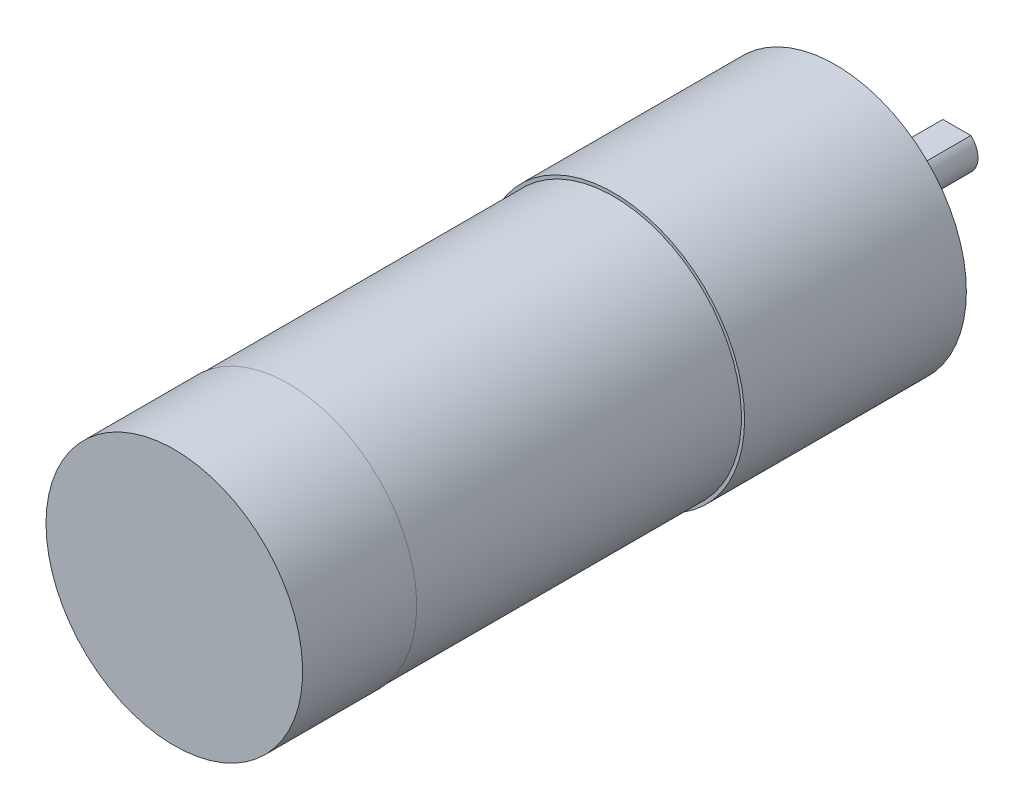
ISO-10303-21;
HEADER;
FILE_DESCRIPTION(('STEP AP214'),'2;1');
FILE_NAME('part.step','',(''),(''),'','','');
FILE_SCHEMA(('AUTOMOTIVE_DESIGN { 1 0 10303 214 1 1 1 1 }'));
ENDSEC;
DATA;
#1=APPLICATION_CONTEXT('core data for automotive mechanical design processes');
#2=APPLICATION_PROTOCOL_DEFINITION('international standard','automotive_design',2000,#1);
#3=PRODUCT_CONTEXT('',#1,'mechanical');
#4=PRODUCT('Part','Part','',(#3));
#5=PRODUCT_RELATED_PRODUCT_CATEGORY('part','',(#4));
#6=PRODUCT_DEFINITION_FORMATION('','',#4);
#7=PRODUCT_DEFINITION_CONTEXT('part definition',#1,'design');
#8=PRODUCT_DEFINITION('design','',#6,#7);
#9=PRODUCT_DEFINITION_SHAPE('','',#8);
#10=(LENGTH_UNIT() NAMED_UNIT(*) SI_UNIT(.MILLI.,.METRE.));
#11=(NAMED_UNIT(*) PLANE_ANGLE_UNIT() SI_UNIT($,.RADIAN.));
#12=(NAMED_UNIT(*) SI_UNIT($,.STERADIAN.) SOLID_ANGLE_UNIT());
#13=UNCERTAINTY_MEASURE_WITH_UNIT(LENGTH_MEASURE(1.E-05),#10,'distance_accuracy_value','');
#14=(GEOMETRIC_REPRESENTATION_CONTEXT(3) GLOBAL_UNCERTAINTY_ASSIGNED_CONTEXT((#13)) GLOBAL_UNIT_ASSIGNED_CONTEXT((#10,
#11,#12)) REPRESENTATION_CONTEXT('',''));
#15=CARTESIAN_POINT('',(0.,0.,0.));
#16=DIRECTION('',(0.,0.,1.));
#17=DIRECTION('',(1.,0.,0.));
#18=AXIS2_PLACEMENT_3D('',#15,#16,#17);
#19=CARTESIAN_POINT('',(0.,0.,21.));
#20=DIRECTION('',(0.,0.,-1.));
#21=DIRECTION('',(-1.,0.,0.));
#22=AXIS2_PLACEMENT_3D('',#19,#20,#21);
#23=CYLINDRICAL_SURFACE('',#22,12.4);
#24=CARTESIAN_POINT('',(0.,0.,21.));
#25=DIRECTION('',(0.,0.,1.));
#26=DIRECTION('',(1.,0.,0.));
#27=AXIS2_PLACEMENT_3D('',#24,#25,#26);
#28=CIRCLE('',#27,12.4);
#29=CARTESIAN_POINT('',(-12.4,0.,21.));
#30=VERTEX_POINT('',#29);
#31=EDGE_CURVE('E123',#30,#30,#28,.T.);
#32=CARTESIAN_POINT('',(0.,0.,0.));
#33=DIRECTION('',(0.,0.,1.));
#34=DIRECTION('',(1.,0.,0.));
#35=AXIS2_PLACEMENT_3D('',#32,#33,#34);
#36=CIRCLE('',#35,12.4);
#37=CARTESIAN_POINT('',(-12.4,0.,0.));
#38=VERTEX_POINT('',#37);
#39=EDGE_CURVE('E46',#38,#38,#36,.T.);
#40=CARTESIAN_POINT('',(-12.4,0.,21.));
#41=CARTESIAN_POINT('',(-12.4,0.,20.78125));
#42=CARTESIAN_POINT('',(-12.4,0.,20.5625));
#43=CARTESIAN_POINT('',(-12.4,0.,20.125));
#44=CARTESIAN_POINT('',(-12.4,0.,19.90625));
#45=CARTESIAN_POINT('',(-12.4,0.,19.46875));
#46=CARTESIAN_POINT('',(-12.4,0.,19.25));
#47=CARTESIAN_POINT('',(-12.4,0.,18.8125));
#48=CARTESIAN_POINT('',(-12.4,0.,18.59375));
#49=CARTESIAN_POINT('',(-12.4,0.,18.15625));
#50=CARTESIAN_POINT('',(-12.4,0.,17.9375));
#51=CARTESIAN_POINT('',(-12.4,0.,17.5));
#52=CARTESIAN_POINT('',(-12.4,0.,17.28125));
#53=CARTESIAN_POINT('',(-12.4,0.,16.84375));
#54=CARTESIAN_POINT('',(-12.4,0.,16.625));
#55=CARTESIAN_POINT('',(-12.4,0.,16.1875));
#56=CARTESIAN_POINT('',(-12.4,0.,15.96875));
#57=CARTESIAN_POINT('',(-12.4,0.,15.53125));
#58=CARTESIAN_POINT('',(-12.4,0.,15.3125));
#59=CARTESIAN_POINT('',(-12.4,0.,14.875));
#60=CARTESIAN_POINT('',(-12.4,0.,14.65625));
#61=CARTESIAN_POINT('',(-12.4,0.,14.21875));
#62=CARTESIAN_POINT('',(-12.4,0.,14.));
#63=CARTESIAN_POINT('',(-12.4,0.,13.5625));
#64=CARTESIAN_POINT('',(-12.4,0.,13.34375));
#65=CARTESIAN_POINT('',(-12.4,0.,12.90625));
#66=CARTESIAN_POINT('',(-12.4,0.,12.6875));
#67=CARTESIAN_POINT('',(-12.4,0.,12.25));
#68=CARTESIAN_POINT('',(-12.4,0.,12.03125));
#69=CARTESIAN_POINT('',(-12.4,0.,11.59375));
#70=CARTESIAN_POINT('',(-12.4,0.,11.375));
#71=CARTESIAN_POINT('',(-12.4,0.,10.9375));
#72=CARTESIAN_POINT('',(-12.4,0.,10.71875));
#73=CARTESIAN_POINT('',(-12.4,0.,10.28125));
#74=CARTESIAN_POINT('',(-12.4,0.,10.0625));
#75=CARTESIAN_POINT('',(-12.4,0.,9.625));
#76=CARTESIAN_POINT('',(-12.4,0.,9.40625));
#77=CARTESIAN_POINT('',(-12.4,0.,8.96875));
#78=CARTESIAN_POINT('',(-12.4,0.,8.75));
#79=CARTESIAN_POINT('',(-12.4,0.,8.3125));
#80=CARTESIAN_POINT('',(-12.4,0.,8.09375));
#81=CARTESIAN_POINT('',(-12.4,0.,7.65625));
#82=CARTESIAN_POINT('',(-12.4,0.,7.4375));
#83=CARTESIAN_POINT('',(-12.4,0.,7.));
#84=CARTESIAN_POINT('',(-12.4,0.,6.78125));
#85=CARTESIAN_POINT('',(-12.4,0.,6.34375));
#86=CARTESIAN_POINT('',(-12.4,0.,6.125));
#87=CARTESIAN_POINT('',(-12.4,0.,5.6875));
#88=CARTESIAN_POINT('',(-12.4,0.,5.46875));
#89=CARTESIAN_POINT('',(-12.4,0.,5.03125));
#90=CARTESIAN_POINT('',(-12.4,0.,4.8125));
#91=CARTESIAN_POINT('',(-12.4,0.,4.375));
#92=CARTESIAN_POINT('',(-12.4,0.,4.15625));
#93=CARTESIAN_POINT('',(-12.4,0.,3.71875));
#94=CARTESIAN_POINT('',(-12.4,0.,3.5));
#95=CARTESIAN_POINT('',(-12.4,0.,3.0625));
#96=CARTESIAN_POINT('',(-12.4,0.,2.84375));
#97=CARTESIAN_POINT('',(-12.4,0.,2.40625));
#98=CARTESIAN_POINT('',(-12.4,0.,2.1875));
#99=CARTESIAN_POINT('',(-12.4,0.,1.75));
#100=CARTESIAN_POINT('',(-12.4,0.,1.53125));
#101=CARTESIAN_POINT('',(-12.4,0.,1.09375));
#102=CARTESIAN_POINT('',(-12.4,0.,0.875000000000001));
#103=CARTESIAN_POINT('',(-12.4,0.,0.4375));
#104=CARTESIAN_POINT('',(-12.4,0.,0.21875));
#105=CARTESIAN_POINT('',(-12.4,0.,0.));
#106=B_SPLINE_CURVE_WITH_KNOTS('',3,(#40,#41,#42,#43,#44,#45,#46,#47,#48,#49,#50,#51,#52,#53,
#54,#55,#56,#57,#58,#59,#60,#61,#62,#63,#64,#65,#66,#67,#68,#69,#70,#71,#72,#73,#74,#75,#76,#77,
#78,#79,#80,#81,#82,#83,#84,#85,#86,#87,#88,#89,#90,#91,#92,#93,#94,#95,#96,#97,#98,#99,#100,
#101,#102,#103,#104,#105),.UNSPECIFIED.,.F.,.F.,(4,2,2,2,2,2,2,2,2,2,2,2,2,2,2,2,2,2,2,2,2,2,2,
2,2,2,2,2,2,2,2,2,4),(0.,0.656249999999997,1.3125,1.96875,2.625,3.28125,3.9375,4.59375,5.25,
5.90625,6.5625,7.21875,7.875,8.53125,9.1875,9.84375,10.5,11.15625,11.8125,12.46875,13.125,
13.78125,14.4375,15.09375,15.75,16.40625,17.0625,17.71875,18.375,19.03125,19.6875,20.34375,21.),.UNSPECIFIED.);
#107=EDGE_CURVE('BSEAM43',#30,#38,#106,.T.);
#108=ORIENTED_EDGE('',*,*,#31,.F.);
#109=ORIENTED_EDGE('',*,*,#39,.T.);
#110=ORIENTED_EDGE('',*,*,#107,.T.);
#111=ORIENTED_EDGE('',*,*,#107,.F.);
#112=EDGE_LOOP('',(#108,#110,#109,#111));
#113=FACE_BOUND('',#112,.T.);
#114=ADVANCED_FACE('F43',(#113),#23,.T.);
#115=CARTESIAN_POINT('',(0.,0.,21.));
#116=DIRECTION('',(0.,0.,1.));
#117=DIRECTION('',(1.,0.,0.));
#118=AXIS2_PLACEMENT_3D('',#115,#116,#117);
#119=PLANE('',#118);
#120=CARTESIAN_POINT('',(0.,0.,21.));
#121=DIRECTION('',(0.,0.,1.));
#122=DIRECTION('',(1.,0.,0.));
#123=AXIS2_PLACEMENT_3D('',#120,#121,#122);
#124=CIRCLE('',#123,12.1);
#125=CARTESIAN_POINT('',(-12.1,0.,21.));
#126=VERTEX_POINT('',#125);
#127=EDGE_CURVE('E113',#126,#126,#124,.T.);
#128=ORIENTED_EDGE('',*,*,#127,.F.);
#129=EDGE_LOOP('',(#128));
#130=FACE_BOUND('',#129,.T.);
#131=ORIENTED_EDGE('',*,*,#31,.T.);
#132=EDGE_LOOP('',(#131));
#133=FACE_BOUND('',#132,.T.);
#134=ADVANCED_FACE('F134',(#130,#133),#119,.T.);
#135=CARTESIAN_POINT('',(0.,0.,0.));
#136=DIRECTION('',(0.,0.,1.));
#137=DIRECTION('',(1.,0.,0.));
#138=AXIS2_PLACEMENT_3D('',#135,#136,#137);
#139=PLANE('',#138);
#140=CARTESIAN_POINT('',(8.5,0.,0.));
#141=DIRECTION('',(0.,0.,-1.));
#142=DIRECTION('',(-1.,0.,0.));
#143=AXIS2_PLACEMENT_3D('',#140,#141,#142);
#144=CIRCLE('',#143,1.25);
#145=CARTESIAN_POINT('',(7.25,0.,0.));
#146=VERTEX_POINT('',#145);
#147=EDGE_CURVE('E89',#146,#146,#144,.T.);
#148=ORIENTED_EDGE('',*,*,#147,.F.);
#149=EDGE_LOOP('',(#148));
#150=FACE_BOUND('',#149,.T.);
#151=CARTESIAN_POINT('',(-8.5,0.,0.));
#152=DIRECTION('',(0.,0.,-1.));
#153=DIRECTION('',(-1.,0.,0.));
#154=AXIS2_PLACEMENT_3D('',#151,#152,#153);
#155=CIRCLE('',#154,1.25);
#156=CARTESIAN_POINT('',(-9.75,0.,0.));
#157=VERTEX_POINT('',#156);
#158=EDGE_CURVE('E88',#157,#157,#155,.T.);
#159=ORIENTED_EDGE('',*,*,#158,.F.);
#160=EDGE_LOOP('',(#159));
#161=FACE_BOUND('',#160,.T.);
#162=CARTESIAN_POINT('',(0.,0.,0.));
#163=DIRECTION('',(0.,0.,-1.));
#164=DIRECTION('',(-1.,0.,0.));
#165=AXIS2_PLACEMENT_3D('',#162,#163,#164);
#166=CIRCLE('',#165,3.5);
#167=CARTESIAN_POINT('',(-3.5,0.,0.));
#168=VERTEX_POINT('',#167);
#169=EDGE_CURVE('E51',#168,#168,#166,.T.);
#170=ORIENTED_EDGE('',*,*,#169,.F.);
#171=EDGE_LOOP('',(#170));
#172=FACE_BOUND('',#171,.T.);
#173=ORIENTED_EDGE('',*,*,#39,.F.);
#174=EDGE_LOOP('',(#173));
#175=FACE_BOUND('',#174,.T.);
#176=ADVANCED_FACE('F131',(#150,#161,#172,#175),#139,.F.);
#177=CARTESIAN_POINT('',(0.,0.,51.8));
#178=DIRECTION('',(0.,0.,-1.));
#179=DIRECTION('',(-1.,0.,0.));
#180=AXIS2_PLACEMENT_3D('',#177,#178,#179);
#181=CYLINDRICAL_SURFACE('',#180,12.1);
#182=CARTESIAN_POINT('',(0.,0.,51.8));
#183=DIRECTION('',(0.,0.,1.));
#184=DIRECTION('',(1.,0.,0.));
#185=AXIS2_PLACEMENT_3D('',#182,#183,#184);
#186=CIRCLE('',#185,12.1);
#187=CARTESIAN_POINT('',(-12.1,0.,51.8));
#188=VERTEX_POINT('',#187);
#189=EDGE_CURVE('E117',#188,#188,#186,.T.);
#190=CARTESIAN_POINT('',(-12.1,0.,51.8));
#191=CARTESIAN_POINT('',(-12.1,0.,51.4791666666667));
#192=CARTESIAN_POINT('',(-12.1,0.,51.1583333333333));
#193=CARTESIAN_POINT('',(-12.1,0.,50.5166666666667));
#194=CARTESIAN_POINT('',(-12.1,0.,50.1958333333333));
#195=CARTESIAN_POINT('',(-12.1,0.,49.5541666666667));
#196=CARTESIAN_POINT('',(-12.1,0.,49.2333333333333));
#197=CARTESIAN_POINT('',(-12.1,0.,48.5916666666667));
#198=CARTESIAN_POINT('',(-12.1,0.,48.2708333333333));
#199=CARTESIAN_POINT('',(-12.1,0.,47.6291666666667));
#200=CARTESIAN_POINT('',(-12.1,0.,47.3083333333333));
#201=CARTESIAN_POINT('',(-12.1,0.,46.6666666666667));
#202=CARTESIAN_POINT('',(-12.1,0.,46.3458333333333));
#203=CARTESIAN_POINT('',(-12.1,0.,45.7041666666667));
#204=CARTESIAN_POINT('',(-12.1,0.,45.3833333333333));
#205=CARTESIAN_POINT('',(-12.1,0.,44.7416666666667));
#206=CARTESIAN_POINT('',(-12.1,0.,44.4208333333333));
#207=CARTESIAN_POINT('',(-12.1,0.,43.7791666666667));
#208=CARTESIAN_POINT('',(-12.1,0.,43.4583333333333));
#209=CARTESIAN_POINT('',(-12.1,0.,42.8166666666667));
#210=CARTESIAN_POINT('',(-12.1,0.,42.4958333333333));
#211=CARTESIAN_POINT('',(-12.1,0.,41.8541666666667));
#212=CARTESIAN_POINT('',(-12.1,0.,41.5333333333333));
#213=CARTESIAN_POINT('',(-12.1,0.,40.8916666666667));
#214=CARTESIAN_POINT('',(-12.1,0.,40.5708333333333));
#215=CARTESIAN_POINT('',(-12.1,0.,39.9291666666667));
#216=CARTESIAN_POINT('',(-12.1,0.,39.6083333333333));
#217=CARTESIAN_POINT('',(-12.1,0.,38.9666666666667));
#218=CARTESIAN_POINT('',(-12.1,0.,38.6458333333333));
#219=CARTESIAN_POINT('',(-12.1,0.,38.0041666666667));
#220=CARTESIAN_POINT('',(-12.1,0.,37.6833333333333));
#221=CARTESIAN_POINT('',(-12.1,0.,37.0416666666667));
#222=CARTESIAN_POINT('',(-12.1,0.,36.7208333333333));
#223=CARTESIAN_POINT('',(-12.1,0.,36.0791666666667));
#224=CARTESIAN_POINT('',(-12.1,0.,35.7583333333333));
#225=CARTESIAN_POINT('',(-12.1,0.,35.1166666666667));
#226=CARTESIAN_POINT('',(-12.1,0.,34.7958333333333));
#227=CARTESIAN_POINT('',(-12.1,0.,34.1541666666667));
#228=CARTESIAN_POINT('',(-12.1,0.,33.8333333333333));
#229=CARTESIAN_POINT('',(-12.1,0.,33.1916666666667));
#230=CARTESIAN_POINT('',(-12.1,0.,32.8708333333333));
#231=CARTESIAN_POINT('',(-12.1,0.,32.2291666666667));
#232=CARTESIAN_POINT('',(-12.1,0.,31.9083333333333));
#233=CARTESIAN_POINT('',(-12.1,0.,31.2666666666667));
#234=CARTESIAN_POINT('',(-12.1,0.,30.9458333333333));
#235=CARTESIAN_POINT('',(-12.1,0.,30.3041666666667));
#236=CARTESIAN_POINT('',(-12.1,0.,29.9833333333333));
#237=CARTESIAN_POINT('',(-12.1,0.,29.3416666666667));
#238=CARTESIAN_POINT('',(-12.1,0.,29.0208333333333));
#239=CARTESIAN_POINT('',(-12.1,0.,28.3791666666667));
#240=CARTESIAN_POINT('',(-12.1,0.,28.0583333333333));
#241=CARTESIAN_POINT('',(-12.1,0.,27.4166666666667));
#242=CARTESIAN_POINT('',(-12.1,0.,27.0958333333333));
#243=CARTESIAN_POINT('',(-12.1,0.,26.4541666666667));
#244=CARTESIAN_POINT('',(-12.1,0.,26.1333333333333));
#245=CARTESIAN_POINT('',(-12.1,0.,25.4916666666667));
#246=CARTESIAN_POINT('',(-12.1,0.,25.1708333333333));
#247=CARTESIAN_POINT('',(-12.1,0.,24.5291666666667));
#248=CARTESIAN_POINT('',(-12.1,0.,24.2083333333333));
#249=CARTESIAN_POINT('',(-12.1,0.,23.5666666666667));
#250=CARTESIAN_POINT('',(-12.1,0.,23.2458333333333));
#251=CARTESIAN_POINT('',(-12.1,0.,22.6041666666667));
#252=CARTESIAN_POINT('',(-12.1,0.,22.2833333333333));
#253=CARTESIAN_POINT('',(-12.1,0.,21.6416666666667));
#254=CARTESIAN_POINT('',(-12.1,0.,21.3208333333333));
#255=CARTESIAN_POINT('',(-12.1,0.,21.));
#256=B_SPLINE_CURVE_WITH_KNOTS('',3,(#190,#191,#192,#193,#194,#195,#196,#197,#198,#199,#200,
#201,#202,#203,#204,#205,#206,#207,#208,#209,#210,#211,#212,#213,#214,#215,#216,#217,#218,#219,
#220,#221,#222,#223,#224,#225,#226,#227,#228,#229,#230,#231,#232,#233,#234,#235,#236,#237,#238,
#239,#240,#241,#242,#243,#244,#245,#246,#247,#248,#249,#250,#251,#252,#253,#254,#255),
.UNSPECIFIED.,.F.,.F.,(4,2,2,2,2,2,2,2,2,2,2,2,2,2,2,2,2,2,2,2,2,2,2,2,2,2,2,2,2,2,2,2,4),(0.,
0.962500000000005,1.925,2.8875,3.85000000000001,4.8125,5.775,6.7375,7.7,8.6625,9.625,10.5875,
11.55,12.5125,13.475,14.4375,15.4,16.3625,17.325,18.2875,19.25,20.2125,21.175,22.1375,23.1,
24.0625,25.025,25.9875,26.95,27.9125,28.875,29.8375,30.8),.UNSPECIFIED.);
#257=EDGE_CURVE('BSEAM133',#188,#126,#256,.T.);
#258=ORIENTED_EDGE('',*,*,#189,.F.);
#259=ORIENTED_EDGE('',*,*,#127,.T.);
#260=ORIENTED_EDGE('',*,*,#257,.T.);
#261=ORIENTED_EDGE('',*,*,#257,.F.);
#262=EDGE_LOOP('',(#258,#260,#259,#261));
#263=FACE_BOUND('',#262,.T.);
#264=ADVANCED_FACE('F133',(#263),#181,.T.);
#265=CARTESIAN_POINT('',(0.,0.,62.6));
#266=DIRECTION('',(0.,0.,-1.));
#267=DIRECTION('',(-1.,0.,0.));
#268=AXIS2_PLACEMENT_3D('',#265,#266,#267);
#269=CYLINDRICAL_SURFACE('',#268,12.15);
#270=CARTESIAN_POINT('',(0.,0.,62.6));
#271=DIRECTION('',(0.,0.,1.));
#272=DIRECTION('',(1.,0.,0.));
#273=AXIS2_PLACEMENT_3D('',#270,#271,#272);
#274=CIRCLE('',#273,12.15);
#275=CARTESIAN_POINT('',(-12.15,0.,62.6));
#276=VERTEX_POINT('',#275);
#277=EDGE_CURVE('E114',#276,#276,#274,.T.);
#278=CARTESIAN_POINT('',(0.,0.,51.8));
#279=DIRECTION('',(0.,0.,1.));
#280=DIRECTION('',(1.,0.,0.));
#281=AXIS2_PLACEMENT_3D('',#278,#279,#280);
#282=CIRCLE('',#281,12.15);
#283=CARTESIAN_POINT('',(-12.15,0.,51.8));
#284=VERTEX_POINT('',#283);
#285=EDGE_CURVE('E110',#284,#284,#282,.T.);
#286=CARTESIAN_POINT('',(-12.15,0.,62.6));
#287=CARTESIAN_POINT('',(-12.15,0.,62.4875));
#288=CARTESIAN_POINT('',(-12.15,0.,62.375));
#289=CARTESIAN_POINT('',(-12.15,0.,62.15));
#290=CARTESIAN_POINT('',(-12.15,0.,62.0375));
#291=CARTESIAN_POINT('',(-12.15,0.,61.8125));
#292=CARTESIAN_POINT('',(-12.15,0.,61.7));
#293=CARTESIAN_POINT('',(-12.15,0.,61.475));
#294=CARTESIAN_POINT('',(-12.15,0.,61.3625));
#295=CARTESIAN_POINT('',(-12.15,0.,61.1375));
#296=CARTESIAN_POINT('',(-12.15,0.,61.025));
#297=CARTESIAN_POINT('',(-12.15,0.,60.8));
#298=CARTESIAN_POINT('',(-12.15,0.,60.6875));
#299=CARTESIAN_POINT('',(-12.15,0.,60.4625));
#300=CARTESIAN_POINT('',(-12.15,0.,60.35));
#301=CARTESIAN_POINT('',(-12.15,0.,60.125));
#302=CARTESIAN_POINT('',(-12.15,0.,60.0125));
#303=CARTESIAN_POINT('',(-12.15,0.,59.7875));
#304=CARTESIAN_POINT('',(-12.15,0.,59.675));
#305=CARTESIAN_POINT('',(-12.15,0.,59.45));
#306=CARTESIAN_POINT('',(-12.15,0.,59.3375));
#307=CARTESIAN_POINT('',(-12.15,0.,59.1125));
#308=CARTESIAN_POINT('',(-12.15,0.,59.));
#309=CARTESIAN_POINT('',(-12.15,0.,58.775));
#310=CARTESIAN_POINT('',(-12.15,0.,58.6625));
#311=CARTESIAN_POINT('',(-12.15,0.,58.4375));
#312=CARTESIAN_POINT('',(-12.15,0.,58.325));
#313=CARTESIAN_POINT('',(-12.15,0.,58.1));
#314=CARTESIAN_POINT('',(-12.15,0.,57.9875));
#315=CARTESIAN_POINT('',(-12.15,0.,57.7625));
#316=CARTESIAN_POINT('',(-12.15,0.,57.65));
#317=CARTESIAN_POINT('',(-12.15,0.,57.425));
#318=CARTESIAN_POINT('',(-12.15,0.,57.3125));
#319=CARTESIAN_POINT('',(-12.15,0.,57.0875));
#320=CARTESIAN_POINT('',(-12.15,0.,56.975));
#321=CARTESIAN_POINT('',(-12.15,0.,56.75));
#322=CARTESIAN_POINT('',(-12.15,0.,56.6375));
#323=CARTESIAN_POINT('',(-12.15,0.,56.4125));
#324=CARTESIAN_POINT('',(-12.15,0.,56.3));
#325=CARTESIAN_POINT('',(-12.15,0.,56.075));
#326=CARTESIAN_POINT('',(-12.15,0.,55.9625));
#327=CARTESIAN_POINT('',(-12.15,0.,55.7375));
#328=CARTESIAN_POINT('',(-12.15,0.,55.625));
#329=CARTESIAN_POINT('',(-12.15,0.,55.4));
#330=CARTESIAN_POINT('',(-12.15,0.,55.2875));
#331=CARTESIAN_POINT('',(-12.15,0.,55.0625));
#332=CARTESIAN_POINT('',(-12.15,0.,54.95));
#333=CARTESIAN_POINT('',(-12.15,0.,54.725));
#334=CARTESIAN_POINT('',(-12.15,0.,54.6125));
#335=CARTESIAN_POINT('',(-12.15,0.,54.3875));
#336=CARTESIAN_POINT('',(-12.15,0.,54.275));
#337=CARTESIAN_POINT('',(-12.15,0.,54.05));
#338=CARTESIAN_POINT('',(-12.15,0.,53.9375));
#339=CARTESIAN_POINT('',(-12.15,0.,53.7125));
#340=CARTESIAN_POINT('',(-12.15,0.,53.6));
#341=CARTESIAN_POINT('',(-12.15,0.,53.375));
#342=CARTESIAN_POINT('',(-12.15,0.,53.2625));
#343=CARTESIAN_POINT('',(-12.15,0.,53.0375));
#344=CARTESIAN_POINT('',(-12.15,0.,52.925));
#345=CARTESIAN_POINT('',(-12.15,0.,52.7));
#346=CARTESIAN_POINT('',(-12.15,0.,52.5875));
#347=CARTESIAN_POINT('',(-12.15,0.,52.3625));
#348=CARTESIAN_POINT('',(-12.15,0.,52.25));
#349=CARTESIAN_POINT('',(-12.15,0.,52.025));
#350=CARTESIAN_POINT('',(-12.15,0.,51.9125));
#351=CARTESIAN_POINT('',(-12.15,0.,51.8));
#352=B_SPLINE_CURVE_WITH_KNOTS('',3,(#286,#287,#288,#289,#290,#291,#292,#293,#294,#295,#296,
#297,#298,#299,#300,#301,#302,#303,#304,#305,#306,#307,#308,#309,#310,#311,#312,#313,#314,#315,
#316,#317,#318,#319,#320,#321,#322,#323,#324,#325,#326,#327,#328,#329,#330,#331,#332,#333,#334,
#335,#336,#337,#338,#339,#340,#341,#342,#343,#344,#345,#346,#347,#348,#349,#350,#351),
.UNSPECIFIED.,.F.,.F.,(4,2,2,2,2,2,2,2,2,2,2,2,2,2,2,2,2,2,2,2,2,2,2,2,2,2,2,2,2,2,2,2,4),(0.,
0.337499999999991,0.674999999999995,1.01249999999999,1.34999999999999,1.68749999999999,
2.02499999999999,2.3625,2.69999999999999,3.03749999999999,3.375,3.71249999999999,
4.04999999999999,4.3875,4.72499999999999,5.0625,5.4,5.73749999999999,6.075,6.41249999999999,
6.74999999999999,7.0875,7.42499999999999,7.76249999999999,8.1,8.43749999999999,8.77499999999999,
9.1125,9.44999999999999,9.7875,10.125,10.4625,10.8),.UNSPECIFIED.);
#353=EDGE_CURVE('BSEAM140',#276,#284,#352,.T.);
#354=ORIENTED_EDGE('',*,*,#277,.F.);
#355=ORIENTED_EDGE('',*,*,#285,.T.);
#356=ORIENTED_EDGE('',*,*,#353,.T.);
#357=ORIENTED_EDGE('',*,*,#353,.F.);
#358=EDGE_LOOP('',(#354,#356,#355,#357));
#359=FACE_BOUND('',#358,.T.);
#360=ADVANCED_FACE('F140',(#359),#269,.T.);
#361=CARTESIAN_POINT('',(0.,0.,62.6));
#362=DIRECTION('',(0.,0.,1.));
#363=DIRECTION('',(1.,0.,0.));
#364=AXIS2_PLACEMENT_3D('',#361,#362,#363);
#365=PLANE('',#364);
#366=ORIENTED_EDGE('',*,*,#277,.T.);
#367=EDGE_LOOP('',(#366));
#368=FACE_BOUND('',#367,.T.);
#369=ADVANCED_FACE('F173',(#368),#365,.T.);
#370=CARTESIAN_POINT('',(0.,0.,51.8));
#371=DIRECTION('',(0.,0.,1.));
#372=DIRECTION('',(1.,0.,0.));
#373=AXIS2_PLACEMENT_3D('',#370,#371,#372);
#374=PLANE('',#373);
#375=ORIENTED_EDGE('',*,*,#189,.T.);
#376=EDGE_LOOP('',(#375));
#377=FACE_BOUND('',#376,.T.);
#378=ORIENTED_EDGE('',*,*,#285,.F.);
#379=EDGE_LOOP('',(#378));
#380=FACE_BOUND('',#379,.T.);
#381=ADVANCED_FACE('F184',(#377,#380),#374,.F.);
#382=CARTESIAN_POINT('',(0.,0.,-2.5));
#383=DIRECTION('',(0.,0.,1.));
#384=DIRECTION('',(1.,0.,0.));
#385=AXIS2_PLACEMENT_3D('',#382,#383,#384);
#386=CYLINDRICAL_SURFACE('',#385,3.5);
#387=CARTESIAN_POINT('',(0.,0.,-2.5));
#388=DIRECTION('',(0.,0.,-1.));
#389=DIRECTION('',(-1.,0.,0.));
#390=AXIS2_PLACEMENT_3D('',#387,#388,#389);
#391=CIRCLE('',#390,3.5);
#392=CARTESIAN_POINT('',(-3.5,0.,-2.5));
#393=VERTEX_POINT('',#392);
#394=EDGE_CURVE('E106',#393,#393,#391,.T.);
#395=ORIENTED_EDGE('',*,*,#394,.F.);
#396=EDGE_LOOP('',(#395));
#397=FACE_BOUND('',#396,.T.);
#398=ORIENTED_EDGE('',*,*,#169,.T.);
#399=EDGE_LOOP('',(#398));
#400=FACE_BOUND('',#399,.T.);
#401=ADVANCED_FACE('F195',(#397,#400),#386,.T.);
#402=CARTESIAN_POINT('',(0.,0.,-2.5));
#403=DIRECTION('',(0.,0.,-1.));
#404=DIRECTION('',(-1.,0.,0.));
#405=AXIS2_PLACEMENT_3D('',#402,#403,#404);
#406=PLANE('',#405);
#407=CARTESIAN_POINT('',(0.,0.,-2.5));
#408=DIRECTION('',(0.,0.,-1.));
#409=DIRECTION('',(-1.,0.,0.));
#410=AXIS2_PLACEMENT_3D('',#407,#408,#409);
#411=CIRCLE('',#410,2.);
#412=CARTESIAN_POINT('',(1.3228756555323,1.5,-2.5));
#413=VERTEX_POINT('',#412);
#414=CARTESIAN_POINT('',(-1.3228756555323,1.5,-2.5));
#415=VERTEX_POINT('',#414);
#416=EDGE_CURVE('E11',#413,#415,#411,.T.);
#417=ORIENTED_EDGE('',*,*,#416,.F.);
#418=DIRECTION('',(-1.,0.,0.));
#419=VECTOR('',#418,1.);
#420=CARTESIAN_POINT('',(1.3228756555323,1.5,-2.5));
#421=LINE('',#420,#419);
#422=EDGE_CURVE('E99',#413,#415,#421,.T.);
#423=ORIENTED_EDGE('',*,*,#422,.T.);
#424=EDGE_LOOP('',(#417,#423));
#425=FACE_BOUND('',#424,.T.);
#426=ORIENTED_EDGE('',*,*,#394,.T.);
#427=EDGE_LOOP('',(#426));
#428=FACE_BOUND('',#427,.T.);
#429=ADVANCED_FACE('F206',(#425,#428),#406,.T.);
#430=CARTESIAN_POINT('',(0.,0.,-11.5));
#431=DIRECTION('',(0.,0.,1.));
#432=DIRECTION('',(1.,0.,0.));
#433=AXIS2_PLACEMENT_3D('',#430,#431,#432);
#434=CYLINDRICAL_SURFACE('',#433,2.);
#435=CARTESIAN_POINT('',(0.,0.,-11.5));
#436=DIRECTION('',(0.,0.,-1.));
#437=DIRECTION('',(-1.,0.,0.));
#438=AXIS2_PLACEMENT_3D('',#435,#436,#437);
#439=CIRCLE('',#438,2.);
#440=CARTESIAN_POINT('',(1.3228756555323,1.5,-11.5));
#441=VERTEX_POINT('',#440);
#442=CARTESIAN_POINT('',(-1.3228756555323,1.5,-11.5));
#443=VERTEX_POINT('',#442);
#444=EDGE_CURVE('E103',#441,#443,#439,.T.);
#445=ORIENTED_EDGE('',*,*,#444,.F.);
#446=DIRECTION('',(0.,0.,-1.));
#447=VECTOR('',#446,1.);
#448=CARTESIAN_POINT('',(1.3228756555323,1.5,-2.5));
#449=LINE('',#448,#447);
#450=EDGE_CURVE('E59',#413,#441,#449,.T.);
#451=ORIENTED_EDGE('',*,*,#450,.F.);
#452=ORIENTED_EDGE('',*,*,#416,.T.);
#453=DIRECTION('',(0.,0.,-1.));
#454=VECTOR('',#453,1.);
#455=CARTESIAN_POINT('',(-1.3228756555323,1.5,-2.5));
#456=LINE('',#455,#454);
#457=EDGE_CURVE('E65',#415,#443,#456,.T.);
#458=ORIENTED_EDGE('',*,*,#457,.T.);
#459=EDGE_LOOP('',(#445,#451,#452,#458));
#460=FACE_BOUND('',#459,.T.);
#461=ADVANCED_FACE('F218',(#460),#434,.T.);
#462=CARTESIAN_POINT('',(0.,0.,-11.5));
#463=DIRECTION('',(0.,0.,-1.));
#464=DIRECTION('',(-1.,0.,0.));
#465=AXIS2_PLACEMENT_3D('',#462,#463,#464);
#466=PLANE('',#465);
#467=DIRECTION('',(-1.,0.,0.));
#468=VECTOR('',#467,1.);
#469=CARTESIAN_POINT('',(1.3228756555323,1.5,-11.5));
#470=LINE('',#469,#468);
#471=EDGE_CURVE('E71',#441,#443,#470,.T.);
#472=ORIENTED_EDGE('',*,*,#471,.F.);
#473=ORIENTED_EDGE('',*,*,#444,.T.);
#474=EDGE_LOOP('',(#472,#473));
#475=FACE_BOUND('',#474,.T.);
#476=ADVANCED_FACE('F230',(#475),#466,.T.);
#477=CARTESIAN_POINT('',(1.3228756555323,1.5,-2.5));
#478=DIRECTION('',(0.,-1.,0.));
#479=DIRECTION('',(0.,0.,-1.));
#480=AXIS2_PLACEMENT_3D('',#477,#478,#479);
#481=PLANE('',#480);
#482=ORIENTED_EDGE('',*,*,#471,.T.);
#483=ORIENTED_EDGE('',*,*,#457,.F.);
#484=ORIENTED_EDGE('',*,*,#422,.F.);
#485=ORIENTED_EDGE('',*,*,#450,.T.);
#486=EDGE_LOOP('',(#482,#483,#484,#485));
#487=FACE_BOUND('',#486,.T.);
#488=ADVANCED_FACE('F240',(#487),#481,.F.);
#489=CARTESIAN_POINT('',(-8.5,0.,5.));
#490=DIRECTION('',(0.,0.,-1.));
#491=DIRECTION('',(-1.,0.,0.));
#492=AXIS2_PLACEMENT_3D('',#489,#490,#491);
#493=CONICAL_SURFACE('',#492,1.25,1.02974425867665);
#494=CARTESIAN_POINT('',(-8.5,0.,5.75107577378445));
#495=VERTEX_POINT('',#494);
#496=VERTEX_LOOP('',#495);
#497=FACE_BOUND('',#496,.T.);
#498=CARTESIAN_POINT('',(-8.5,0.,5.));
#499=DIRECTION('',(0.,0.,-1.));
#500=DIRECTION('',(-1.,0.,0.));
#501=AXIS2_PLACEMENT_3D('',#498,#499,#500);
#502=CIRCLE('',#501,1.25);
#503=CARTESIAN_POINT('',(-9.75,0.,5.));
#504=VERTEX_POINT('',#503);
#505=EDGE_CURVE('E92',#504,#504,#502,.T.);
#506=ORIENTED_EDGE('',*,*,#505,.T.);
#507=EDGE_LOOP('',(#506));
#508=FACE_BOUND('',#507,.T.);
#509=ADVANCED_FACE('F249',(#497,#508),#493,.F.);
#510=CARTESIAN_POINT('',(-8.5,0.,0.));
#511=DIRECTION('',(0.,0.,-1.));
#512=DIRECTION('',(-1.,0.,0.));
#513=AXIS2_PLACEMENT_3D('',#510,#511,#512);
#514=CYLINDRICAL_SURFACE('',#513,1.25);
#515=ORIENTED_EDGE('',*,*,#505,.F.);
#516=EDGE_LOOP('',(#515));
#517=FACE_BOUND('',#516,.T.);
#518=ORIENTED_EDGE('',*,*,#158,.T.);
#519=EDGE_LOOP('',(#518));
#520=FACE_BOUND('',#519,.T.);
#521=ADVANCED_FACE('F82',(#517,#520),#514,.F.);
#522=CARTESIAN_POINT('',(8.5,0.,5.));
#523=DIRECTION('',(0.,0.,-1.));
#524=DIRECTION('',(-1.,0.,0.));
#525=AXIS2_PLACEMENT_3D('',#522,#523,#524);
#526=CONICAL_SURFACE('',#525,1.25,1.02974425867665);
#527=CARTESIAN_POINT('',(8.5,0.,5.75107577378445));
#528=VERTEX_POINT('',#527);
#529=VERTEX_LOOP('',#528);
#530=FACE_BOUND('',#529,.T.);
#531=CARTESIAN_POINT('',(8.5,0.,5.));
#532=DIRECTION('',(0.,0.,-1.));
#533=DIRECTION('',(-1.,0.,0.));
#534=AXIS2_PLACEMENT_3D('',#531,#532,#533);
#535=CIRCLE('',#534,1.25);
#536=CARTESIAN_POINT('',(7.25,0.,5.));
#537=VERTEX_POINT('',#536);
#538=EDGE_CURVE('E86',#537,#537,#535,.T.);
#539=ORIENTED_EDGE('',*,*,#538,.T.);
#540=EDGE_LOOP('',(#539));
#541=FACE_BOUND('',#540,.T.);
#542=ADVANCED_FACE('F78',(#530,#541),#526,.F.);
#543=CARTESIAN_POINT('',(8.5,0.,0.));
#544=DIRECTION('',(0.,0.,-1.));
#545=DIRECTION('',(-1.,0.,0.));
#546=AXIS2_PLACEMENT_3D('',#543,#544,#545);
#547=CYLINDRICAL_SURFACE('',#546,1.25);
#548=ORIENTED_EDGE('',*,*,#538,.F.);
#549=EDGE_LOOP('',(#548));
#550=FACE_BOUND('',#549,.T.);
#551=ORIENTED_EDGE('',*,*,#147,.T.);
#552=EDGE_LOOP('',(#551));
#553=FACE_BOUND('',#552,.T.);
#554=ADVANCED_FACE('F81',(#550,#553),#547,.F.);
#555=CLOSED_SHELL('',(#114,#134,#176,#264,#360,#369,#381,#401,#429,#461,#476,#488,#509,#521,
#542,#554));
#556=MANIFOLD_SOLID_BREP('B2',#555);
#557=ADVANCED_BREP_SHAPE_REPRESENTATION('',(#18,#556),#14);
#558=SHAPE_DEFINITION_REPRESENTATION(#9,#557);
ENDSEC;
END-ISO-10303-21;
